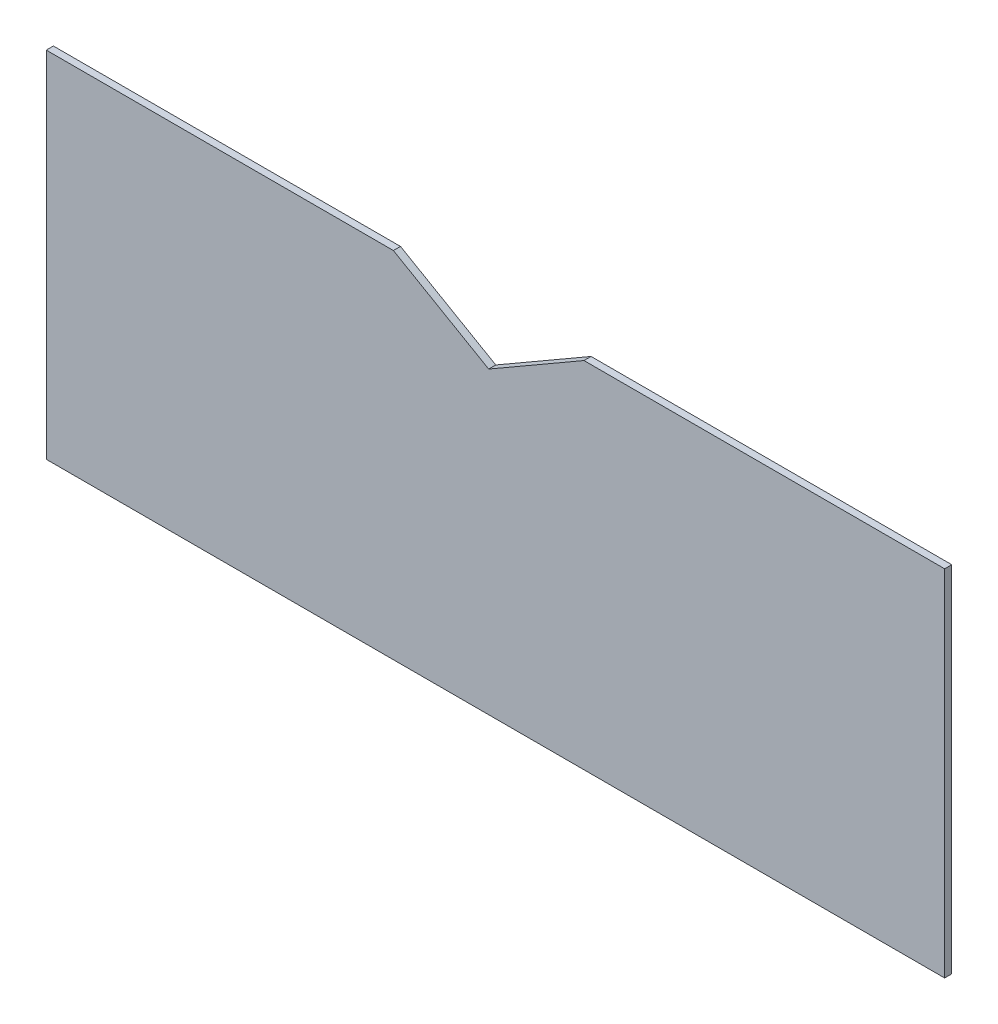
ISO-10303-21;
HEADER;
FILE_DESCRIPTION(('STEP AP214'),'2;1');
FILE_NAME('part.step','',(''),(''),'','','');
FILE_SCHEMA(('AUTOMOTIVE_DESIGN { 1 0 10303 214 1 1 1 1 }'));
ENDSEC;
DATA;
#1=APPLICATION_CONTEXT('core data for automotive mechanical design processes');
#2=APPLICATION_PROTOCOL_DEFINITION('international standard','automotive_design',2000,#1);
#3=PRODUCT_CONTEXT('',#1,'mechanical');
#4=PRODUCT('Part','Part','',(#3));
#5=PRODUCT_RELATED_PRODUCT_CATEGORY('part','',(#4));
#6=PRODUCT_DEFINITION_FORMATION('','',#4);
#7=PRODUCT_DEFINITION_CONTEXT('part definition',#1,'design');
#8=PRODUCT_DEFINITION('design','',#6,#7);
#9=PRODUCT_DEFINITION_SHAPE('','',#8);
#10=(LENGTH_UNIT() NAMED_UNIT(*) SI_UNIT(.MILLI.,.METRE.));
#11=(NAMED_UNIT(*) PLANE_ANGLE_UNIT() SI_UNIT($,.RADIAN.));
#12=(NAMED_UNIT(*) SI_UNIT($,.STERADIAN.) SOLID_ANGLE_UNIT());
#13=UNCERTAINTY_MEASURE_WITH_UNIT(LENGTH_MEASURE(1.E-05),#10,'distance_accuracy_value','');
#14=(GEOMETRIC_REPRESENTATION_CONTEXT(3) GLOBAL_UNCERTAINTY_ASSIGNED_CONTEXT((#13)) GLOBAL_UNIT_ASSIGNED_CONTEXT((#10,
#11,#12)) REPRESENTATION_CONTEXT('',''));
#15=CARTESIAN_POINT('',(0.,0.,0.));
#16=DIRECTION('',(0.,0.,1.));
#17=DIRECTION('',(1.,0.,0.));
#18=AXIS2_PLACEMENT_3D('',#15,#16,#17);
#19=CARTESIAN_POINT('',(0.,37.5,-1.));
#20=DIRECTION('',(0.,0.,-1.));
#21=DIRECTION('',(-1.,0.,0.));
#22=AXIS2_PLACEMENT_3D('',#19,#20,#21);
#23=PLANE('',#22);
#24=DIRECTION('',(0.866025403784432,-0.500000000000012,0.));
#25=VECTOR('',#24,1.);
#26=CARTESIAN_POINT('',(-5.1038559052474,45.5970942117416,-1.00000000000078));
#27=LINE('',#26,#25);
#28=CARTESIAN_POINT('',(-12.604191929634,49.927415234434,-1.00000000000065));
#29=VERTEX_POINT('',#28);
#30=CARTESIAN_POINT('',(0.821902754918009,42.1758558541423,-0.999999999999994));
#31=VERTEX_POINT('',#30);
#32=EDGE_CURVE('E235',#29,#31,#27,.T.);
#33=ORIENTED_EDGE('',*,*,#32,.T.);
#34=DIRECTION('',(0.866025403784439,0.5,0.));
#35=VECTOR('',#34,1.);
#36=CARTESIAN_POINT('',(45.3600405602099,67.8899617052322,-0.999999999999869));
#37=LINE('',#36,#35);
#38=CARTESIAN_POINT('',(14.2479974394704,49.927415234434,-0.999999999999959));
#39=VERTEX_POINT('',#38);
#40=EDGE_CURVE('E171',#31,#39,#37,.T.);
#41=ORIENTED_EDGE('',*,*,#40,.T.);
#42=DIRECTION('',(1.,0.,0.));
#43=VECTOR('',#42,1.);
#44=CARTESIAN_POINT('',(65.05375110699,49.927415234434,-0.999999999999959));
#45=LINE('',#44,#43);
#46=CARTESIAN_POINT('',(65.05375110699,49.927415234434,-0.999999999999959));
#47=VERTEX_POINT('',#46);
#48=EDGE_CURVE('E226',#47,#39,#45,.F.);
#49=ORIENTED_EDGE('',*,*,#48,.F.);
#50=DIRECTION('',(0.,1.,0.));
#51=VECTOR('',#50,1.);
#52=CARTESIAN_POINT('',(65.05375110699,49.927415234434,-0.999999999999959));
#53=LINE('',#52,#51);
#54=CARTESIAN_POINT('',(65.05375110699,0.,-1.));
#55=VERTEX_POINT('',#54);
#56=EDGE_CURVE('E222',#47,#55,#53,.F.);
#57=ORIENTED_EDGE('',*,*,#56,.T.);
#58=DIRECTION('',(-1.,0.,0.));
#59=VECTOR('',#58,1.);
#60=CARTESIAN_POINT('',(1.64380550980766,0.,-1.));
#61=LINE('',#60,#59);
#62=CARTESIAN_POINT('',(-61.5027657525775,0.,-1.));
#63=VERTEX_POINT('',#62);
#64=EDGE_CURVE('E202',#63,#55,#61,.F.);
#65=ORIENTED_EDGE('',*,*,#64,.F.);
#66=DIRECTION('',(0.,-1.,0.));
#67=VECTOR('',#66,1.);
#68=CARTESIAN_POINT('',(-61.5027657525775,37.5,-1.));
#69=LINE('',#68,#67);
#70=CARTESIAN_POINT('',(-61.5027657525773,49.927415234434,-0.999999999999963));
#71=VERTEX_POINT('',#70);
#72=EDGE_CURVE('E13',#71,#63,#69,.T.);
#73=ORIENTED_EDGE('',*,*,#72,.F.);
#74=DIRECTION('',(1.,0.,0.));
#75=VECTOR('',#74,1.);
#76=CARTESIAN_POINT('',(-0.356194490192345,49.927415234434,-1.00000000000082));
#77=LINE('',#76,#75);
#78=EDGE_CURVE('E218',#29,#71,#77,.F.);
#79=ORIENTED_EDGE('',*,*,#78,.F.);
#80=EDGE_LOOP('',(#33,#41,#49,#57,#65,#73,#79));
#81=FACE_BOUND('',#80,.T.);
#82=ADVANCED_FACE('F127',(#81),#23,.T.);
#83=CARTESIAN_POINT('',(-61.5027657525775,37.5,0.));
#84=DIRECTION('',(-1.,0.,0.));
#85=DIRECTION('',(0.,0.,1.));
#86=AXIS2_PLACEMENT_3D('',#83,#84,#85);
#87=PLANE('',#86);
#88=DIRECTION('',(0.,-1.,0.));
#89=VECTOR('',#88,1.);
#90=CARTESIAN_POINT('',(-61.5027657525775,37.5,0.));
#91=LINE('',#90,#89);
#92=CARTESIAN_POINT('',(-61.5027657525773,49.927415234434,0.));
#93=VERTEX_POINT('',#92);
#94=CARTESIAN_POINT('',(-61.5027657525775,0.,0.));
#95=VERTEX_POINT('',#94);
#96=EDGE_CURVE('E137',#93,#95,#91,.T.);
#97=ORIENTED_EDGE('',*,*,#96,.F.);
#98=DIRECTION('',(0.,0.,-1.));
#99=VECTOR('',#98,1.);
#100=CARTESIAN_POINT('',(-61.5027657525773,49.927415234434,0.));
#101=LINE('',#100,#99);
#102=EDGE_CURVE('E233',#93,#71,#101,.T.);
#103=ORIENTED_EDGE('',*,*,#102,.T.);
#104=ORIENTED_EDGE('',*,*,#72,.T.);
#105=DIRECTION('',(0.,0.,-1.));
#106=VECTOR('',#105,1.);
#107=CARTESIAN_POINT('',(-61.5027657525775,0.,0.));
#108=LINE('',#107,#106);
#109=EDGE_CURVE('E208',#95,#63,#108,.T.);
#110=ORIENTED_EDGE('',*,*,#109,.F.);
#111=EDGE_LOOP('',(#97,#103,#104,#110));
#112=FACE_BOUND('',#111,.T.);
#113=ADVANCED_FACE('F252',(#112),#87,.T.);
#114=CARTESIAN_POINT('',(1.64380550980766,37.5,0.));
#115=DIRECTION('',(0.,0.,-1.));
#116=DIRECTION('',(-1.,0.,0.));
#117=AXIS2_PLACEMENT_3D('',#114,#115,#116);
#118=PLANE('',#117);
#119=DIRECTION('',(0.866025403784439,0.5,0.));
#120=VECTOR('',#119,1.);
#121=CARTESIAN_POINT('',(45.3600405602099,67.8899617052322,1.31838984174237E-13));
#122=LINE('',#121,#120);
#123=CARTESIAN_POINT('',(0.821902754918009,42.1758558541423,0.));
#124=VERTEX_POINT('',#123);
#125=CARTESIAN_POINT('',(14.2479974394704,49.927415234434,0.));
#126=VERTEX_POINT('',#125);
#127=EDGE_CURVE('E177',#124,#126,#122,.T.);
#128=ORIENTED_EDGE('',*,*,#127,.F.);
#129=DIRECTION('',(0.866025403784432,-0.500000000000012,0.));
#130=VECTOR('',#129,1.);
#131=CARTESIAN_POINT('',(-5.10385590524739,45.5970942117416,-7.75720547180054E-13));
#132=LINE('',#131,#130);
#133=CARTESIAN_POINT('',(-12.6041919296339,49.927415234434,-6.45972702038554E-13));
#134=VERTEX_POINT('',#133);
#135=EDGE_CURVE('E232',#134,#124,#132,.T.);
#136=ORIENTED_EDGE('',*,*,#135,.F.);
#137=DIRECTION('',(1.,0.,0.));
#138=VECTOR('',#137,1.);
#139=CARTESIAN_POINT('',(-0.356194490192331,49.927415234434,-8.18695100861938E-13));
#140=LINE('',#139,#138);
#141=EDGE_CURVE('E230',#134,#93,#140,.F.);
#142=ORIENTED_EDGE('',*,*,#141,.T.);
#143=ORIENTED_EDGE('',*,*,#96,.T.);
#144=DIRECTION('',(1.,0.,0.));
#145=VECTOR('',#144,1.);
#146=CARTESIAN_POINT('',(1.64380550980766,0.,0.));
#147=LINE('',#146,#145);
#148=CARTESIAN_POINT('',(65.05375110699,0.,0.));
#149=VERTEX_POINT('',#148);
#150=EDGE_CURVE('E204',#95,#149,#147,.T.);
#151=ORIENTED_EDGE('',*,*,#150,.T.);
#152=DIRECTION('',(0.,1.,0.));
#153=VECTOR('',#152,1.);
#154=CARTESIAN_POINT('',(65.05375110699,49.927415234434,0.));
#155=LINE('',#154,#153);
#156=CARTESIAN_POINT('',(65.05375110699,49.927415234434,0.));
#157=VERTEX_POINT('',#156);
#158=EDGE_CURVE('E206',#157,#149,#155,.F.);
#159=ORIENTED_EDGE('',*,*,#158,.F.);
#160=DIRECTION('',(1.,0.,0.));
#161=VECTOR('',#160,1.);
#162=CARTESIAN_POINT('',(65.05375110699,49.927415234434,0.));
#163=LINE('',#162,#161);
#164=EDGE_CURVE('E224',#157,#126,#163,.F.);
#165=ORIENTED_EDGE('',*,*,#164,.T.);
#166=EDGE_LOOP('',(#128,#136,#142,#143,#151,#159,#165));
#167=FACE_BOUND('',#166,.T.);
#168=ADVANCED_FACE('F205',(#167),#118,.F.);
#169=CARTESIAN_POINT('',(-0.356194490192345,0.,-2.));
#170=DIRECTION('',(0.,1.,0.));
#171=DIRECTION('',(1.,0.,0.));
#172=AXIS2_PLACEMENT_3D('',#169,#170,#171);
#173=PLANE('',#172);
#174=ORIENTED_EDGE('',*,*,#64,.T.);
#175=DIRECTION('',(0.,0.,1.));
#176=VECTOR('',#175,1.);
#177=CARTESIAN_POINT('',(65.05375110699,0.,-1.));
#178=LINE('',#177,#176);
#179=EDGE_CURVE('E212',#55,#149,#178,.T.);
#180=ORIENTED_EDGE('',*,*,#179,.T.);
#181=ORIENTED_EDGE('',*,*,#150,.F.);
#182=ORIENTED_EDGE('',*,*,#109,.T.);
#183=EDGE_LOOP('',(#174,#180,#181,#182));
#184=FACE_BOUND('',#183,.T.);
#185=ADVANCED_FACE('F214',(#184),#173,.F.);
#186=CARTESIAN_POINT('',(-0.356194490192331,49.927415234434,-8.18695100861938E-13));
#187=DIRECTION('',(0.,1.,0.));
#188=DIRECTION('',(1.,0.,0.));
#189=AXIS2_PLACEMENT_3D('',#186,#187,#188);
#190=PLANE('',#189);
#191=ORIENTED_EDGE('',*,*,#102,.F.);
#192=ORIENTED_EDGE('',*,*,#141,.F.);
#193=DIRECTION('',(0.,0.,-1.));
#194=VECTOR('',#193,1.);
#195=CARTESIAN_POINT('',(-12.6041919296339,49.927415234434,-6.45972702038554E-13));
#196=LINE('',#195,#194);
#197=EDGE_CURVE('E215',#134,#29,#196,.T.);
#198=ORIENTED_EDGE('',*,*,#197,.T.);
#199=ORIENTED_EDGE('',*,*,#78,.T.);
#200=EDGE_LOOP('',(#191,#192,#198,#199));
#201=FACE_BOUND('',#200,.T.);
#202=ADVANCED_FACE('F255',(#201),#190,.T.);
#203=CARTESIAN_POINT('',(-5.10385590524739,45.5970942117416,-7.75720547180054E-13));
#204=DIRECTION('',(0.500000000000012,0.866025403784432,0.));
#205=DIRECTION('',(0.866025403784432,-0.500000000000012,0.));
#206=AXIS2_PLACEMENT_3D('',#203,#204,#205);
#207=PLANE('',#206);
#208=ORIENTED_EDGE('',*,*,#135,.T.);
#209=DIRECTION('',(0.,0.,-1.));
#210=VECTOR('',#209,1.);
#211=CARTESIAN_POINT('',(0.821902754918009,42.1758558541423,4.75541717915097E-13));
#212=LINE('',#211,#210);
#213=EDGE_CURVE('E131',#124,#31,#212,.T.);
#214=ORIENTED_EDGE('',*,*,#213,.T.);
#215=ORIENTED_EDGE('',*,*,#32,.F.);
#216=ORIENTED_EDGE('',*,*,#197,.F.);
#217=EDGE_LOOP('',(#208,#214,#215,#216));
#218=FACE_BOUND('',#217,.T.);
#219=ADVANCED_FACE('F129',(#218),#207,.T.);
#220=CARTESIAN_POINT('',(65.05375110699,49.927415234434,0.));
#221=DIRECTION('',(-1.,0.,0.));
#222=DIRECTION('',(0.,1.,0.));
#223=AXIS2_PLACEMENT_3D('',#220,#221,#222);
#224=PLANE('',#223);
#225=DIRECTION('',(0.,0.,-1.));
#226=VECTOR('',#225,1.);
#227=CARTESIAN_POINT('',(65.05375110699,49.927415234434,0.));
#228=LINE('',#227,#226);
#229=EDGE_CURVE('E185',#157,#47,#228,.T.);
#230=ORIENTED_EDGE('',*,*,#229,.F.);
#231=ORIENTED_EDGE('',*,*,#158,.T.);
#232=ORIENTED_EDGE('',*,*,#179,.F.);
#233=ORIENTED_EDGE('',*,*,#56,.F.);
#234=EDGE_LOOP('',(#230,#231,#232,#233));
#235=FACE_BOUND('',#234,.T.);
#236=ADVANCED_FACE('F211',(#235),#224,.F.);
#237=CARTESIAN_POINT('',(65.05375110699,49.927415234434,0.));
#238=DIRECTION('',(0.,1.,0.));
#239=DIRECTION('',(1.,0.,0.));
#240=AXIS2_PLACEMENT_3D('',#237,#238,#239);
#241=PLANE('',#240);
#242=DIRECTION('',(0.,0.,-1.));
#243=VECTOR('',#242,1.);
#244=CARTESIAN_POINT('',(14.2479974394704,49.927415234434,0.));
#245=LINE('',#244,#243);
#246=EDGE_CURVE('E216',#126,#39,#245,.T.);
#247=ORIENTED_EDGE('',*,*,#246,.F.);
#248=ORIENTED_EDGE('',*,*,#164,.F.);
#249=ORIENTED_EDGE('',*,*,#229,.T.);
#250=ORIENTED_EDGE('',*,*,#48,.T.);
#251=EDGE_LOOP('',(#247,#248,#249,#250));
#252=FACE_BOUND('',#251,.T.);
#253=ADVANCED_FACE('F251',(#252),#241,.T.);
#254=CARTESIAN_POINT('',(45.3600405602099,67.8899617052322,1.31838984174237E-13));
#255=DIRECTION('',(-0.5,0.866025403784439,0.));
#256=DIRECTION('',(0.866025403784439,0.5,0.));
#257=AXIS2_PLACEMENT_3D('',#254,#255,#256);
#258=PLANE('',#257);
#259=ORIENTED_EDGE('',*,*,#127,.T.);
#260=ORIENTED_EDGE('',*,*,#246,.T.);
#261=ORIENTED_EDGE('',*,*,#40,.F.);
#262=ORIENTED_EDGE('',*,*,#213,.F.);
#263=EDGE_LOOP('',(#259,#260,#261,#262));
#264=FACE_BOUND('',#263,.T.);
#265=ADVANCED_FACE('F249',(#264),#258,.T.);
#266=CLOSED_SHELL('',(#82,#113,#168,#185,#202,#219,#236,#253,#265));
#267=MANIFOLD_SOLID_BREP('B2',#266);
#268=ADVANCED_BREP_SHAPE_REPRESENTATION('',(#18,#267),#14);
#269=SHAPE_DEFINITION_REPRESENTATION(#9,#268);
ENDSEC;
END-ISO-10303-21;
